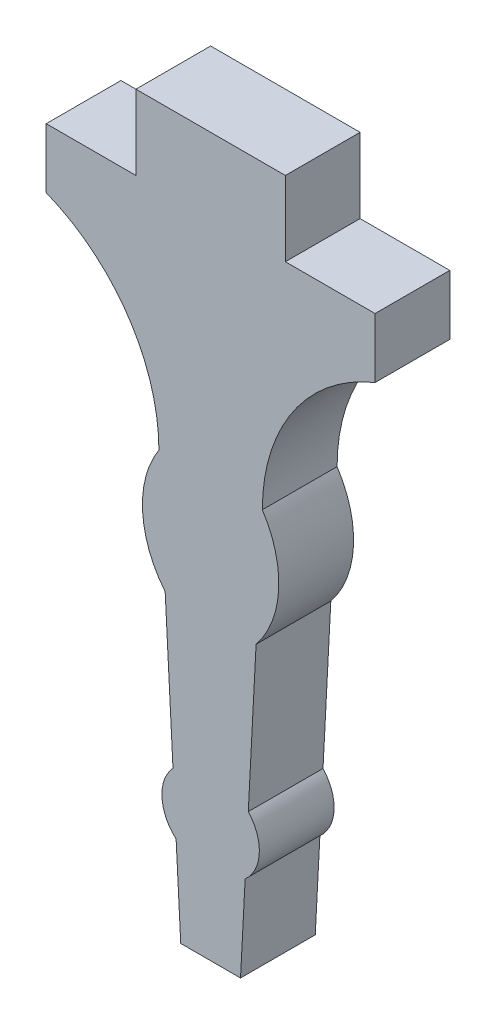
ISO-10303-21;
HEADER;
FILE_DESCRIPTION(('STEP AP214'),'2;1');
FILE_NAME('part.step','',(''),(''),'','','');
FILE_SCHEMA(('AUTOMOTIVE_DESIGN { 1 0 10303 214 1 1 1 1 }'));
ENDSEC;
DATA;
#1=APPLICATION_CONTEXT('core data for automotive mechanical design processes');
#2=APPLICATION_PROTOCOL_DEFINITION('international standard','automotive_design',2000,#1);
#3=PRODUCT_CONTEXT('',#1,'mechanical');
#4=PRODUCT('Part','Part','',(#3));
#5=PRODUCT_RELATED_PRODUCT_CATEGORY('part','',(#4));
#6=PRODUCT_DEFINITION_FORMATION('','',#4);
#7=PRODUCT_DEFINITION_CONTEXT('part definition',#1,'design');
#8=PRODUCT_DEFINITION('design','',#6,#7);
#9=PRODUCT_DEFINITION_SHAPE('','',#8);
#10=(LENGTH_UNIT() NAMED_UNIT(*) SI_UNIT(.MILLI.,.METRE.));
#11=(NAMED_UNIT(*) PLANE_ANGLE_UNIT() SI_UNIT($,.RADIAN.));
#12=(NAMED_UNIT(*) SI_UNIT($,.STERADIAN.) SOLID_ANGLE_UNIT());
#13=UNCERTAINTY_MEASURE_WITH_UNIT(LENGTH_MEASURE(1.E-05),#10,'distance_accuracy_value','');
#14=(GEOMETRIC_REPRESENTATION_CONTEXT(3) GLOBAL_UNCERTAINTY_ASSIGNED_CONTEXT((#13)) GLOBAL_UNIT_ASSIGNED_CONTEXT((#10,
#11,#12)) REPRESENTATION_CONTEXT('',''));
#15=CARTESIAN_POINT('',(0.,0.,0.));
#16=DIRECTION('',(0.,0.,1.));
#17=DIRECTION('',(1.,0.,0.));
#18=AXIS2_PLACEMENT_3D('',#15,#16,#17);
#19=CARTESIAN_POINT('',(-3.175,-3.175,3.175));
#20=DIRECTION('',(0.,-1.,0.));
#21=DIRECTION('',(1.,0.,0.));
#22=AXIS2_PLACEMENT_3D('',#19,#20,#21);
#23=PLANE('',#22);
#24=DIRECTION('',(-1.,0.,0.));
#25=VECTOR('',#24,1.);
#26=CARTESIAN_POINT('',(-3.175,-3.175,0.));
#27=LINE('',#26,#25);
#28=CARTESIAN_POINT('',(-3.175,-3.175,0.));
#29=VERTEX_POINT('',#28);
#30=CARTESIAN_POINT('',(-6.985,-3.175,0.));
#31=VERTEX_POINT('',#30);
#32=EDGE_CURVE('E189',#29,#31,#27,.T.);
#33=ORIENTED_EDGE('',*,*,#32,.T.);
#34=DIRECTION('',(0.,0.,-1.));
#35=VECTOR('',#34,1.);
#36=CARTESIAN_POINT('',(-6.985,-3.175,3.175));
#37=LINE('',#36,#35);
#38=CARTESIAN_POINT('',(-6.985,-3.175,3.175));
#39=VERTEX_POINT('',#38);
#40=EDGE_CURVE('E11',#39,#31,#37,.T.);
#41=ORIENTED_EDGE('',*,*,#40,.F.);
#42=DIRECTION('',(-1.,0.,0.));
#43=VECTOR('',#42,1.);
#44=CARTESIAN_POINT('',(-3.175,-3.175,3.175));
#45=LINE('',#44,#43);
#46=CARTESIAN_POINT('',(-3.175,-3.175,3.175));
#47=VERTEX_POINT('',#46);
#48=EDGE_CURVE('E223',#47,#39,#45,.T.);
#49=ORIENTED_EDGE('',*,*,#48,.F.);
#50=DIRECTION('',(0.,0.,-1.));
#51=VECTOR('',#50,1.);
#52=CARTESIAN_POINT('',(-3.175,-3.175,3.175));
#53=LINE('',#52,#51);
#54=EDGE_CURVE('E185',#47,#29,#53,.T.);
#55=ORIENTED_EDGE('',*,*,#54,.T.);
#56=EDGE_LOOP('',(#33,#41,#49,#55));
#57=FACE_BOUND('',#56,.T.);
#58=ADVANCED_FACE('F33',(#57),#23,.F.);
#59=CARTESIAN_POINT('',(-6.985,-3.175,3.175));
#60=DIRECTION('',(1.,0.,0.));
#61=DIRECTION('',(0.,1.,0.));
#62=AXIS2_PLACEMENT_3D('',#59,#60,#61);
#63=PLANE('',#62);
#64=DIRECTION('',(0.,-1.,0.));
#65=VECTOR('',#64,1.);
#66=CARTESIAN_POINT('',(-6.985,-3.175,0.));
#67=LINE('',#66,#65);
#68=CARTESIAN_POINT('',(-6.985,-5.715,0.));
#69=VERTEX_POINT('',#68);
#70=EDGE_CURVE('E192',#31,#69,#67,.T.);
#71=ORIENTED_EDGE('',*,*,#70,.T.);
#72=DIRECTION('',(0.,0.,-1.));
#73=VECTOR('',#72,1.);
#74=CARTESIAN_POINT('',(-6.985,-5.715,3.175));
#75=LINE('',#74,#73);
#76=CARTESIAN_POINT('',(-6.985,-5.715,3.175));
#77=VERTEX_POINT('',#76);
#78=EDGE_CURVE('E41',#77,#69,#75,.T.);
#79=ORIENTED_EDGE('',*,*,#78,.F.);
#80=DIRECTION('',(0.,-1.,0.));
#81=VECTOR('',#80,1.);
#82=CARTESIAN_POINT('',(-6.985,-3.175,3.175));
#83=LINE('',#82,#81);
#84=EDGE_CURVE('E122',#39,#77,#83,.T.);
#85=ORIENTED_EDGE('',*,*,#84,.F.);
#86=ORIENTED_EDGE('',*,*,#40,.T.);
#87=EDGE_LOOP('',(#71,#79,#85,#86));
#88=FACE_BOUND('',#87,.T.);
#89=ADVANCED_FACE('F331',(#88),#63,.F.);
#90=CARTESIAN_POINT('',(-9.81713893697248,-12.7891352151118,3.175));
#91=DIRECTION('',(0.,0.,-1.));
#92=DIRECTION('',(-1.,0.,0.));
#93=AXIS2_PLACEMENT_3D('',#90,#91,#92);
#94=CYLINDRICAL_SURFACE('',#93,7.62);
#95=CARTESIAN_POINT('',(-9.81713893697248,-12.7891352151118,0.));
#96=DIRECTION('',(0.,0.,-1.));
#97=DIRECTION('',(-1.,0.,0.));
#98=AXIS2_PLACEMENT_3D('',#95,#96,#97);
#99=CIRCLE('',#98,7.62);
#100=CARTESIAN_POINT('',(-2.19713893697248,-12.7891352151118,0.));
#101=VERTEX_POINT('',#100);
#102=EDGE_CURVE('E194',#69,#101,#99,.T.);
#103=ORIENTED_EDGE('',*,*,#102,.T.);
#104=DIRECTION('',(0.,0.,-1.));
#105=VECTOR('',#104,1.);
#106=CARTESIAN_POINT('',(-2.19713893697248,-12.7891352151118,3.175));
#107=LINE('',#106,#105);
#108=CARTESIAN_POINT('',(-2.19713893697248,-12.7891352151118,3.175));
#109=VERTEX_POINT('',#108);
#110=EDGE_CURVE('E260',#109,#101,#107,.T.);
#111=ORIENTED_EDGE('',*,*,#110,.F.);
#112=CARTESIAN_POINT('',(-9.81713893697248,-12.7891352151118,3.175));
#113=DIRECTION('',(0.,0.,-1.));
#114=DIRECTION('',(-1.,0.,0.));
#115=AXIS2_PLACEMENT_3D('',#112,#113,#114);
#116=CIRCLE('',#115,7.62);
#117=EDGE_CURVE('E268',#77,#109,#116,.T.);
#118=ORIENTED_EDGE('',*,*,#117,.F.);
#119=ORIENTED_EDGE('',*,*,#78,.T.);
#120=EDGE_LOOP('',(#103,#111,#118,#119));
#121=FACE_BOUND('',#120,.T.);
#122=ADVANCED_FACE('F266',(#121),#94,.F.);
#123=CARTESIAN_POINT('',(1.42057924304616,-15.1465149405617,3.175));
#124=DIRECTION('',(0.,0.,-1.));
#125=DIRECTION('',(-1.,0.,0.));
#126=AXIS2_PLACEMENT_3D('',#123,#124,#125);
#127=CYLINDRICAL_SURFACE('',#126,4.318);
#128=CARTESIAN_POINT('',(1.42057924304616,-15.1465149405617,0.));
#129=DIRECTION('',(0.,0.,1.));
#130=DIRECTION('',(1.,0.,0.));
#131=AXIS2_PLACEMENT_3D('',#128,#129,#130);
#132=CIRCLE('',#131,4.318);
#133=CARTESIAN_POINT('',(-1.93090741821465,-17.8691352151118,0.));
#134=VERTEX_POINT('',#133);
#135=EDGE_CURVE('E196',#101,#134,#132,.T.);
#136=ORIENTED_EDGE('',*,*,#135,.T.);
#137=DIRECTION('',(0.,0.,-1.));
#138=VECTOR('',#137,1.);
#139=CARTESIAN_POINT('',(-1.93090741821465,-17.8691352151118,3.175));
#140=LINE('',#139,#138);
#141=CARTESIAN_POINT('',(-1.93090741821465,-17.8691352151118,3.175));
#142=VERTEX_POINT('',#141);
#143=EDGE_CURVE('E257',#142,#134,#140,.T.);
#144=ORIENTED_EDGE('',*,*,#143,.F.);
#145=CARTESIAN_POINT('',(1.42057924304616,-15.1465149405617,3.175));
#146=DIRECTION('',(0.,0.,1.));
#147=DIRECTION('',(1.,0.,0.));
#148=AXIS2_PLACEMENT_3D('',#145,#146,#147);
#149=CIRCLE('',#148,4.318);
#150=EDGE_CURVE('E286',#109,#142,#149,.T.);
#151=ORIENTED_EDGE('',*,*,#150,.F.);
#152=ORIENTED_EDGE('',*,*,#110,.T.);
#153=EDGE_LOOP('',(#136,#144,#151,#152));
#154=FACE_BOUND('',#153,.T.);
#155=ADVANCED_FACE('F277',(#154),#127,.T.);
#156=CARTESIAN_POINT('',(-1.93090741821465,-17.8691352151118,3.175));
#157=DIRECTION('',(0.998629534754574,0.0523359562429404,0.));
#158=DIRECTION('',(-0.0523359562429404,0.998629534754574,0.));
#159=AXIS2_PLACEMENT_3D('',#156,#157,#158);
#160=PLANE('',#159);
#161=DIRECTION('',(0.0523359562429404,-0.998629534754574,0.));
#162=VECTOR('',#161,1.);
#163=CARTESIAN_POINT('',(-1.93090741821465,-17.8691352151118,0.));
#164=LINE('',#163,#162);
#165=CARTESIAN_POINT('',(-1.59938129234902,-24.1950305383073,0.));
#166=VERTEX_POINT('',#165);
#167=EDGE_CURVE('E198',#134,#166,#164,.T.);
#168=ORIENTED_EDGE('',*,*,#167,.T.);
#169=DIRECTION('',(0.,0.,-1.));
#170=VECTOR('',#169,1.);
#171=CARTESIAN_POINT('',(-1.59938129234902,-24.1950305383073,3.175));
#172=LINE('',#171,#170);
#173=CARTESIAN_POINT('',(-1.59938129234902,-24.1950305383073,3.175));
#174=VERTEX_POINT('',#173);
#175=EDGE_CURVE('E254',#174,#166,#172,.T.);
#176=ORIENTED_EDGE('',*,*,#175,.F.);
#177=DIRECTION('',(0.0523359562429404,-0.998629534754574,0.));
#178=VECTOR('',#177,1.);
#179=CARTESIAN_POINT('',(-1.93090741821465,-17.8691352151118,3.175));
#180=LINE('',#179,#178);
#181=EDGE_CURVE('E283',#142,#174,#180,.T.);
#182=ORIENTED_EDGE('',*,*,#181,.F.);
#183=ORIENTED_EDGE('',*,*,#143,.T.);
#184=EDGE_LOOP('',(#168,#176,#182,#183));
#185=FACE_BOUND('',#184,.T.);
#186=ADVANCED_FACE('F281',(#185),#160,.F.);
#187=CARTESIAN_POINT('',(-0.291966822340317,-25.4,3.175));
#188=DIRECTION('',(0.,0.,-1.));
#189=DIRECTION('',(-1.,0.,0.));
#190=AXIS2_PLACEMENT_3D('',#187,#188,#189);
#191=CYLINDRICAL_SURFACE('',#190,1.778);
#192=CARTESIAN_POINT('',(-0.291966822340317,-25.4,0.));
#193=DIRECTION('',(0.,0.,1.));
#194=DIRECTION('',(-1.,0.,0.));
#195=AXIS2_PLACEMENT_3D('',#192,#193,#194);
#196=CIRCLE('',#195,1.778);
#197=CARTESIAN_POINT('',(-1.4662655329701,-26.7350305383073,0.));
#198=VERTEX_POINT('',#197);
#199=EDGE_CURVE('E200',#166,#198,#196,.T.);
#200=ORIENTED_EDGE('',*,*,#199,.T.);
#201=DIRECTION('',(0.,0.,-1.));
#202=VECTOR('',#201,1.);
#203=CARTESIAN_POINT('',(-1.4662655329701,-26.7350305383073,3.175));
#204=LINE('',#203,#202);
#205=CARTESIAN_POINT('',(-1.4662655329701,-26.7350305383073,3.175));
#206=VERTEX_POINT('',#205);
#207=EDGE_CURVE('E251',#206,#198,#204,.T.);
#208=ORIENTED_EDGE('',*,*,#207,.F.);
#209=CARTESIAN_POINT('',(-0.291966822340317,-25.4,3.175));
#210=DIRECTION('',(0.,0.,1.));
#211=DIRECTION('',(-1.,0.,0.));
#212=AXIS2_PLACEMENT_3D('',#209,#210,#211);
#213=CIRCLE('',#212,1.778);
#214=EDGE_CURVE('E285',#174,#206,#213,.T.);
#215=ORIENTED_EDGE('',*,*,#214,.F.);
#216=ORIENTED_EDGE('',*,*,#175,.T.);
#217=EDGE_LOOP('',(#200,#208,#215,#216));
#218=FACE_BOUND('',#217,.T.);
#219=ADVANCED_FACE('F344',(#218),#191,.T.);
#220=CARTESIAN_POINT('',(-1.4662655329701,-26.7350305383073,3.175));
#221=DIRECTION('',(0.998629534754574,0.0523359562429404,0.));
#222=DIRECTION('',(-0.0523359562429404,0.998629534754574,0.));
#223=AXIS2_PLACEMENT_3D('',#220,#221,#222);
#224=PLANE('',#223);
#225=DIRECTION('',(0.0523359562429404,-0.998629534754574,0.));
#226=VECTOR('',#225,1.);
#227=CARTESIAN_POINT('',(-1.4662655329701,-26.7350305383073,0.));
#228=LINE('',#227,#226);
#229=CARTESIAN_POINT('',(-1.27,-30.48,0.));
#230=VERTEX_POINT('',#229);
#231=EDGE_CURVE('E202',#198,#230,#228,.T.);
#232=ORIENTED_EDGE('',*,*,#231,.T.);
#233=DIRECTION('',(0.,0.,-1.));
#234=VECTOR('',#233,1.);
#235=CARTESIAN_POINT('',(-1.27,-30.48,3.175));
#236=LINE('',#235,#234);
#237=CARTESIAN_POINT('',(-1.27,-30.48,3.175));
#238=VERTEX_POINT('',#237);
#239=EDGE_CURVE('E248',#238,#230,#236,.T.);
#240=ORIENTED_EDGE('',*,*,#239,.F.);
#241=DIRECTION('',(0.0523359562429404,-0.998629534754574,0.));
#242=VECTOR('',#241,1.);
#243=CARTESIAN_POINT('',(-1.4662655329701,-26.7350305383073,3.175));
#244=LINE('',#243,#242);
#245=EDGE_CURVE('E288',#206,#238,#244,.T.);
#246=ORIENTED_EDGE('',*,*,#245,.F.);
#247=ORIENTED_EDGE('',*,*,#207,.T.);
#248=EDGE_LOOP('',(#232,#240,#246,#247));
#249=FACE_BOUND('',#248,.T.);
#250=ADVANCED_FACE('F347',(#249),#224,.F.);
#251=CARTESIAN_POINT('',(-1.27,-30.48,3.175));
#252=DIRECTION('',(0.,1.,0.));
#253=DIRECTION('',(0.,0.,1.));
#254=AXIS2_PLACEMENT_3D('',#251,#252,#253);
#255=PLANE('',#254);
#256=DIRECTION('',(1.,0.,0.));
#257=VECTOR('',#256,1.);
#258=CARTESIAN_POINT('',(-1.27,-30.48,0.));
#259=LINE('',#258,#257);
#260=CARTESIAN_POINT('',(1.27,-30.48,0.));
#261=VERTEX_POINT('',#260);
#262=EDGE_CURVE('E204',#230,#261,#259,.T.);
#263=ORIENTED_EDGE('',*,*,#262,.T.);
#264=DIRECTION('',(0.,0.,-1.));
#265=VECTOR('',#264,1.);
#266=CARTESIAN_POINT('',(1.27,-30.48,3.175));
#267=LINE('',#266,#265);
#268=CARTESIAN_POINT('',(1.27,-30.48,3.175));
#269=VERTEX_POINT('',#268);
#270=EDGE_CURVE('E245',#269,#261,#267,.T.);
#271=ORIENTED_EDGE('',*,*,#270,.F.);
#272=DIRECTION('',(1.,0.,0.));
#273=VECTOR('',#272,1.);
#274=CARTESIAN_POINT('',(-1.27,-30.48,3.175));
#275=LINE('',#274,#273);
#276=EDGE_CURVE('E294',#238,#269,#275,.T.);
#277=ORIENTED_EDGE('',*,*,#276,.F.);
#278=ORIENTED_EDGE('',*,*,#239,.T.);
#279=EDGE_LOOP('',(#263,#271,#277,#278));
#280=FACE_BOUND('',#279,.T.);
#281=ADVANCED_FACE('F351',(#280),#255,.F.);
#282=CARTESIAN_POINT('',(1.46626553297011,-26.7350305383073,3.175));
#283=DIRECTION('',(-0.998629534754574,0.0523359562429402,0.));
#284=DIRECTION('',(-0.0523359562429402,-0.998629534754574,0.));
#285=AXIS2_PLACEMENT_3D('',#282,#283,#284);
#286=PLANE('',#285);
#287=DIRECTION('',(0.0523359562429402,0.998629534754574,0.));
#288=VECTOR('',#287,1.);
#289=CARTESIAN_POINT('',(1.46626553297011,-26.7350305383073,0.));
#290=LINE('',#289,#288);
#291=CARTESIAN_POINT('',(1.46626553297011,-26.7350305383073,0.));
#292=VERTEX_POINT('',#291);
#293=EDGE_CURVE('E206',#261,#292,#290,.T.);
#294=ORIENTED_EDGE('',*,*,#293,.T.);
#295=DIRECTION('',(0.,0.,-1.));
#296=VECTOR('',#295,1.);
#297=CARTESIAN_POINT('',(1.46626553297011,-26.7350305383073,3.175));
#298=LINE('',#297,#296);
#299=CARTESIAN_POINT('',(1.46626553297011,-26.7350305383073,3.175));
#300=VERTEX_POINT('',#299);
#301=EDGE_CURVE('E242',#300,#292,#298,.T.);
#302=ORIENTED_EDGE('',*,*,#301,.F.);
#303=DIRECTION('',(0.0523359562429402,0.998629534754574,0.));
#304=VECTOR('',#303,1.);
#305=CARTESIAN_POINT('',(1.46626553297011,-26.7350305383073,3.175));
#306=LINE('',#305,#304);
#307=EDGE_CURVE('E296',#269,#300,#306,.T.);
#308=ORIENTED_EDGE('',*,*,#307,.F.);
#309=ORIENTED_EDGE('',*,*,#270,.T.);
#310=EDGE_LOOP('',(#294,#302,#308,#309));
#311=FACE_BOUND('',#310,.T.);
#312=ADVANCED_FACE('F355',(#311),#286,.F.);
#313=CARTESIAN_POINT('',(0.291966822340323,-25.4,3.175));
#314=DIRECTION('',(0.,0.,-1.));
#315=DIRECTION('',(-1.,0.,0.));
#316=AXIS2_PLACEMENT_3D('',#313,#314,#315);
#317=CYLINDRICAL_SURFACE('',#316,1.778);
#318=CARTESIAN_POINT('',(0.291966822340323,-25.4,0.));
#319=DIRECTION('',(0.,0.,1.));
#320=DIRECTION('',(1.,0.,0.));
#321=AXIS2_PLACEMENT_3D('',#318,#319,#320);
#322=CIRCLE('',#321,1.778);
#323=CARTESIAN_POINT('',(1.59938129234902,-24.1950305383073,0.));
#324=VERTEX_POINT('',#323);
#325=EDGE_CURVE('E208',#292,#324,#322,.T.);
#326=ORIENTED_EDGE('',*,*,#325,.T.);
#327=DIRECTION('',(0.,0.,-1.));
#328=VECTOR('',#327,1.);
#329=CARTESIAN_POINT('',(1.59938129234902,-24.1950305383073,3.175));
#330=LINE('',#329,#328);
#331=CARTESIAN_POINT('',(1.59938129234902,-24.1950305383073,3.175));
#332=VERTEX_POINT('',#331);
#333=EDGE_CURVE('E239',#332,#324,#330,.T.);
#334=ORIENTED_EDGE('',*,*,#333,.F.);
#335=CARTESIAN_POINT('',(0.291966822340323,-25.4,3.175));
#336=DIRECTION('',(0.,0.,1.));
#337=DIRECTION('',(1.,0.,0.));
#338=AXIS2_PLACEMENT_3D('',#335,#336,#337);
#339=CIRCLE('',#338,1.778);
#340=EDGE_CURVE('E298',#300,#332,#339,.T.);
#341=ORIENTED_EDGE('',*,*,#340,.F.);
#342=ORIENTED_EDGE('',*,*,#301,.T.);
#343=EDGE_LOOP('',(#326,#334,#341,#342));
#344=FACE_BOUND('',#343,.T.);
#345=ADVANCED_FACE('F359',(#344),#317,.T.);
#346=CARTESIAN_POINT('',(1.93090741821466,-17.8691352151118,3.175));
#347=DIRECTION('',(-0.998629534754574,0.0523359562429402,0.));
#348=DIRECTION('',(-0.0523359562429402,-0.998629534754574,0.));
#349=AXIS2_PLACEMENT_3D('',#346,#347,#348);
#350=PLANE('',#349);
#351=DIRECTION('',(0.0523359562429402,0.998629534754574,0.));
#352=VECTOR('',#351,1.);
#353=CARTESIAN_POINT('',(1.93090741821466,-17.8691352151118,0.));
#354=LINE('',#353,#352);
#355=CARTESIAN_POINT('',(1.93090741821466,-17.8691352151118,0.));
#356=VERTEX_POINT('',#355);
#357=EDGE_CURVE('E210',#324,#356,#354,.T.);
#358=ORIENTED_EDGE('',*,*,#357,.T.);
#359=DIRECTION('',(0.,0.,-1.));
#360=VECTOR('',#359,1.);
#361=CARTESIAN_POINT('',(1.93090741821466,-17.8691352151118,3.175));
#362=LINE('',#361,#360);
#363=CARTESIAN_POINT('',(1.93090741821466,-17.8691352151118,3.175));
#364=VERTEX_POINT('',#363);
#365=EDGE_CURVE('E236',#364,#356,#362,.T.);
#366=ORIENTED_EDGE('',*,*,#365,.F.);
#367=DIRECTION('',(0.0523359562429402,0.998629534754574,0.));
#368=VECTOR('',#367,1.);
#369=CARTESIAN_POINT('',(1.93090741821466,-17.8691352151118,3.175));
#370=LINE('',#369,#368);
#371=EDGE_CURVE('E300',#332,#364,#370,.T.);
#372=ORIENTED_EDGE('',*,*,#371,.F.);
#373=ORIENTED_EDGE('',*,*,#333,.T.);
#374=EDGE_LOOP('',(#358,#366,#372,#373));
#375=FACE_BOUND('',#374,.T.);
#376=ADVANCED_FACE('F363',(#375),#350,.F.);
#377=CARTESIAN_POINT('',(-1.42057924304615,-15.1465149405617,3.175));
#378=DIRECTION('',(0.,0.,-1.));
#379=DIRECTION('',(-1.,0.,0.));
#380=AXIS2_PLACEMENT_3D('',#377,#378,#379);
#381=CYLINDRICAL_SURFACE('',#380,4.318);
#382=CARTESIAN_POINT('',(-1.42057924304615,-15.1465149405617,0.));
#383=DIRECTION('',(0.,0.,1.));
#384=DIRECTION('',(-1.,0.,0.));
#385=AXIS2_PLACEMENT_3D('',#382,#383,#384);
#386=CIRCLE('',#385,4.318);
#387=CARTESIAN_POINT('',(2.19713893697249,-12.7891352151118,0.));
#388=VERTEX_POINT('',#387);
#389=EDGE_CURVE('E212',#356,#388,#386,.T.);
#390=ORIENTED_EDGE('',*,*,#389,.T.);
#391=DIRECTION('',(0.,0.,-1.));
#392=VECTOR('',#391,1.);
#393=CARTESIAN_POINT('',(2.19713893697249,-12.7891352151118,3.175));
#394=LINE('',#393,#392);
#395=CARTESIAN_POINT('',(2.19713893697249,-12.7891352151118,3.175));
#396=VERTEX_POINT('',#395);
#397=EDGE_CURVE('E233',#396,#388,#394,.T.);
#398=ORIENTED_EDGE('',*,*,#397,.F.);
#399=CARTESIAN_POINT('',(-1.42057924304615,-15.1465149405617,3.175));
#400=DIRECTION('',(0.,0.,1.));
#401=DIRECTION('',(-1.,0.,0.));
#402=AXIS2_PLACEMENT_3D('',#399,#400,#401);
#403=CIRCLE('',#402,4.318);
#404=EDGE_CURVE('E302',#364,#396,#403,.T.);
#405=ORIENTED_EDGE('',*,*,#404,.F.);
#406=ORIENTED_EDGE('',*,*,#365,.T.);
#407=EDGE_LOOP('',(#390,#398,#405,#406));
#408=FACE_BOUND('',#407,.T.);
#409=ADVANCED_FACE('F367',(#408),#381,.T.);
#410=CARTESIAN_POINT('',(9.81713893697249,-12.7891352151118,3.175));
#411=DIRECTION('',(0.,0.,-1.));
#412=DIRECTION('',(-1.,0.,0.));
#413=AXIS2_PLACEMENT_3D('',#410,#411,#412);
#414=CYLINDRICAL_SURFACE('',#413,7.62);
#415=CARTESIAN_POINT('',(9.81713893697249,-12.7891352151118,0.));
#416=DIRECTION('',(0.,0.,-1.));
#417=DIRECTION('',(1.,0.,0.));
#418=AXIS2_PLACEMENT_3D('',#415,#416,#417);
#419=CIRCLE('',#418,7.62);
#420=CARTESIAN_POINT('',(6.985,-5.715,0.));
#421=VERTEX_POINT('',#420);
#422=EDGE_CURVE('E214',#388,#421,#419,.T.);
#423=ORIENTED_EDGE('',*,*,#422,.T.);
#424=DIRECTION('',(0.,0.,-1.));
#425=VECTOR('',#424,1.);
#426=CARTESIAN_POINT('',(6.985,-5.715,3.175));
#427=LINE('',#426,#425);
#428=CARTESIAN_POINT('',(6.985,-5.715,3.175));
#429=VERTEX_POINT('',#428);
#430=EDGE_CURVE('E230',#429,#421,#427,.T.);
#431=ORIENTED_EDGE('',*,*,#430,.F.);
#432=CARTESIAN_POINT('',(9.81713893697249,-12.7891352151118,3.175));
#433=DIRECTION('',(0.,0.,-1.));
#434=DIRECTION('',(1.,0.,0.));
#435=AXIS2_PLACEMENT_3D('',#432,#433,#434);
#436=CIRCLE('',#435,7.62);
#437=EDGE_CURVE('E304',#396,#429,#436,.T.);
#438=ORIENTED_EDGE('',*,*,#437,.F.);
#439=ORIENTED_EDGE('',*,*,#397,.T.);
#440=EDGE_LOOP('',(#423,#431,#438,#439));
#441=FACE_BOUND('',#440,.T.);
#442=ADVANCED_FACE('F371',(#441),#414,.F.);
#443=CARTESIAN_POINT('',(6.985,-3.175,3.175));
#444=DIRECTION('',(-1.,0.,0.));
#445=DIRECTION('',(0.,0.,1.));
#446=AXIS2_PLACEMENT_3D('',#443,#444,#445);
#447=PLANE('',#446);
#448=DIRECTION('',(0.,1.,0.));
#449=VECTOR('',#448,1.);
#450=CARTESIAN_POINT('',(6.985,-3.175,0.));
#451=LINE('',#450,#449);
#452=CARTESIAN_POINT('',(6.985,-3.175,0.));
#453=VERTEX_POINT('',#452);
#454=EDGE_CURVE('E216',#421,#453,#451,.T.);
#455=ORIENTED_EDGE('',*,*,#454,.T.);
#456=DIRECTION('',(0.,0.,-1.));
#457=VECTOR('',#456,1.);
#458=CARTESIAN_POINT('',(6.985,-3.175,3.175));
#459=LINE('',#458,#457);
#460=CARTESIAN_POINT('',(6.985,-3.175,3.175));
#461=VERTEX_POINT('',#460);
#462=EDGE_CURVE('E227',#461,#453,#459,.T.);
#463=ORIENTED_EDGE('',*,*,#462,.F.);
#464=DIRECTION('',(0.,1.,0.));
#465=VECTOR('',#464,1.);
#466=CARTESIAN_POINT('',(6.985,-3.175,3.175));
#467=LINE('',#466,#465);
#468=EDGE_CURVE('E306',#429,#461,#467,.T.);
#469=ORIENTED_EDGE('',*,*,#468,.F.);
#470=ORIENTED_EDGE('',*,*,#430,.T.);
#471=EDGE_LOOP('',(#455,#463,#469,#470));
#472=FACE_BOUND('',#471,.T.);
#473=ADVANCED_FACE('F312',(#472),#447,.F.);
#474=CARTESIAN_POINT('',(3.175,-3.175,3.175));
#475=DIRECTION('',(0.,-1.,0.));
#476=DIRECTION('',(1.,0.,0.));
#477=AXIS2_PLACEMENT_3D('',#474,#475,#476);
#478=PLANE('',#477);
#479=DIRECTION('',(-1.,0.,0.));
#480=VECTOR('',#479,1.);
#481=CARTESIAN_POINT('',(3.175,-3.175,0.));
#482=LINE('',#481,#480);
#483=CARTESIAN_POINT('',(3.175,-3.175,0.));
#484=VERTEX_POINT('',#483);
#485=EDGE_CURVE('E218',#453,#484,#482,.T.);
#486=ORIENTED_EDGE('',*,*,#485,.T.);
#487=DIRECTION('',(0.,0.,-1.));
#488=VECTOR('',#487,1.);
#489=CARTESIAN_POINT('',(3.175,-3.175,3.175));
#490=LINE('',#489,#488);
#491=CARTESIAN_POINT('',(3.175,-3.175,3.175));
#492=VERTEX_POINT('',#491);
#493=EDGE_CURVE('E180',#492,#484,#490,.T.);
#494=ORIENTED_EDGE('',*,*,#493,.F.);
#495=DIRECTION('',(-1.,0.,0.));
#496=VECTOR('',#495,1.);
#497=CARTESIAN_POINT('',(3.175,-3.175,3.175));
#498=LINE('',#497,#496);
#499=EDGE_CURVE('E171',#461,#492,#498,.T.);
#500=ORIENTED_EDGE('',*,*,#499,.F.);
#501=ORIENTED_EDGE('',*,*,#462,.T.);
#502=EDGE_LOOP('',(#486,#494,#500,#501));
#503=FACE_BOUND('',#502,.T.);
#504=ADVANCED_FACE('F316',(#503),#478,.F.);
#505=CARTESIAN_POINT('',(3.175,0.,3.175));
#506=DIRECTION('',(-1.,0.,0.));
#507=DIRECTION('',(0.,-1.,0.));
#508=AXIS2_PLACEMENT_3D('',#505,#506,#507);
#509=PLANE('',#508);
#510=DIRECTION('',(0.,1.,0.));
#511=VECTOR('',#510,1.);
#512=CARTESIAN_POINT('',(3.175,0.,0.));
#513=LINE('',#512,#511);
#514=CARTESIAN_POINT('',(3.175,0.,0.));
#515=VERTEX_POINT('',#514);
#516=EDGE_CURVE('E179',#484,#515,#513,.T.);
#517=ORIENTED_EDGE('',*,*,#516,.T.);
#518=DIRECTION('',(0.,0.,-1.));
#519=VECTOR('',#518,1.);
#520=CARTESIAN_POINT('',(3.175,0.,3.175));
#521=LINE('',#520,#519);
#522=CARTESIAN_POINT('',(3.175,0.,3.175));
#523=VERTEX_POINT('',#522);
#524=EDGE_CURVE('E176',#523,#515,#521,.T.);
#525=ORIENTED_EDGE('',*,*,#524,.F.);
#526=DIRECTION('',(0.,1.,0.));
#527=VECTOR('',#526,1.);
#528=CARTESIAN_POINT('',(3.175,0.,3.175));
#529=LINE('',#528,#527);
#530=EDGE_CURVE('E165',#492,#523,#529,.T.);
#531=ORIENTED_EDGE('',*,*,#530,.F.);
#532=ORIENTED_EDGE('',*,*,#493,.T.);
#533=EDGE_LOOP('',(#517,#525,#531,#532));
#534=FACE_BOUND('',#533,.T.);
#535=ADVANCED_FACE('F177',(#534),#509,.F.);
#536=CARTESIAN_POINT('',(3.175,0.,3.175));
#537=DIRECTION('',(0.,-1.,0.));
#538=DIRECTION('',(0.,0.,-1.));
#539=AXIS2_PLACEMENT_3D('',#536,#537,#538);
#540=PLANE('',#539);
#541=DIRECTION('',(-1.,0.,0.));
#542=VECTOR('',#541,1.);
#543=CARTESIAN_POINT('',(3.175,0.,0.));
#544=LINE('',#543,#542);
#545=CARTESIAN_POINT('',(-3.175,0.,0.));
#546=VERTEX_POINT('',#545);
#547=EDGE_CURVE('E108',#515,#546,#544,.T.);
#548=ORIENTED_EDGE('',*,*,#547,.T.);
#549=DIRECTION('',(0.,0.,-1.));
#550=VECTOR('',#549,1.);
#551=CARTESIAN_POINT('',(-3.175,0.,3.175));
#552=LINE('',#551,#550);
#553=CARTESIAN_POINT('',(-3.175,0.,3.175));
#554=VERTEX_POINT('',#553);
#555=EDGE_CURVE('E181',#554,#546,#552,.T.);
#556=ORIENTED_EDGE('',*,*,#555,.F.);
#557=DIRECTION('',(-1.,0.,0.));
#558=VECTOR('',#557,1.);
#559=CARTESIAN_POINT('',(3.175,0.,3.175));
#560=LINE('',#559,#558);
#561=EDGE_CURVE('E169',#523,#554,#560,.T.);
#562=ORIENTED_EDGE('',*,*,#561,.F.);
#563=ORIENTED_EDGE('',*,*,#524,.T.);
#564=EDGE_LOOP('',(#548,#556,#562,#563));
#565=FACE_BOUND('',#564,.T.);
#566=ADVANCED_FACE('F183',(#565),#540,.F.);
#567=CARTESIAN_POINT('',(-3.175,0.,3.175));
#568=DIRECTION('',(1.,0.,0.));
#569=DIRECTION('',(0.,1.,0.));
#570=AXIS2_PLACEMENT_3D('',#567,#568,#569);
#571=PLANE('',#570);
#572=DIRECTION('',(0.,-1.,0.));
#573=VECTOR('',#572,1.);
#574=CARTESIAN_POINT('',(-3.175,0.,0.));
#575=LINE('',#574,#573);
#576=EDGE_CURVE('E114',#546,#29,#575,.T.);
#577=ORIENTED_EDGE('',*,*,#576,.T.);
#578=ORIENTED_EDGE('',*,*,#54,.F.);
#579=DIRECTION('',(0.,-1.,0.));
#580=VECTOR('',#579,1.);
#581=CARTESIAN_POINT('',(-3.175,0.,3.175));
#582=LINE('',#581,#580);
#583=EDGE_CURVE('E49',#554,#47,#582,.T.);
#584=ORIENTED_EDGE('',*,*,#583,.F.);
#585=ORIENTED_EDGE('',*,*,#555,.T.);
#586=EDGE_LOOP('',(#577,#578,#584,#585));
#587=FACE_BOUND('',#586,.T.);
#588=ADVANCED_FACE('F320',(#587),#571,.F.);
#589=CARTESIAN_POINT('',(-9.81713893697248,-12.7891352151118,3.175));
#590=DIRECTION('',(0.,0.,-1.));
#591=DIRECTION('',(-1.,0.,0.));
#592=AXIS2_PLACEMENT_3D('',#589,#590,#591);
#593=PLANE('',#592);
#594=ORIENTED_EDGE('',*,*,#48,.T.);
#595=ORIENTED_EDGE('',*,*,#84,.T.);
#596=ORIENTED_EDGE('',*,*,#117,.T.);
#597=ORIENTED_EDGE('',*,*,#150,.T.);
#598=ORIENTED_EDGE('',*,*,#181,.T.);
#599=ORIENTED_EDGE('',*,*,#214,.T.);
#600=ORIENTED_EDGE('',*,*,#245,.T.);
#601=ORIENTED_EDGE('',*,*,#276,.T.);
#602=ORIENTED_EDGE('',*,*,#307,.T.);
#603=ORIENTED_EDGE('',*,*,#340,.T.);
#604=ORIENTED_EDGE('',*,*,#371,.T.);
#605=ORIENTED_EDGE('',*,*,#404,.T.);
#606=ORIENTED_EDGE('',*,*,#437,.T.);
#607=ORIENTED_EDGE('',*,*,#468,.T.);
#608=ORIENTED_EDGE('',*,*,#499,.T.);
#609=ORIENTED_EDGE('',*,*,#530,.T.);
#610=ORIENTED_EDGE('',*,*,#561,.T.);
#611=ORIENTED_EDGE('',*,*,#583,.T.);
#612=EDGE_LOOP('',(#594,#595,#596,#597,#598,#599,#600,#601,#602,#603,#604,#605,#606,#607,#608,
#609,#610,#611));
#613=FACE_BOUND('',#612,.T.);
#614=ADVANCED_FACE('F167',(#613),#593,.F.);
#615=CARTESIAN_POINT('',(-9.81713893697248,-12.7891352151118,0.));
#616=DIRECTION('',(0.,0.,-1.));
#617=DIRECTION('',(-1.,0.,0.));
#618=AXIS2_PLACEMENT_3D('',#615,#616,#617);
#619=PLANE('',#618);
#620=ORIENTED_EDGE('',*,*,#32,.F.);
#621=ORIENTED_EDGE('',*,*,#576,.F.);
#622=ORIENTED_EDGE('',*,*,#547,.F.);
#623=ORIENTED_EDGE('',*,*,#516,.F.);
#624=ORIENTED_EDGE('',*,*,#485,.F.);
#625=ORIENTED_EDGE('',*,*,#454,.F.);
#626=ORIENTED_EDGE('',*,*,#422,.F.);
#627=ORIENTED_EDGE('',*,*,#389,.F.);
#628=ORIENTED_EDGE('',*,*,#357,.F.);
#629=ORIENTED_EDGE('',*,*,#325,.F.);
#630=ORIENTED_EDGE('',*,*,#293,.F.);
#631=ORIENTED_EDGE('',*,*,#262,.F.);
#632=ORIENTED_EDGE('',*,*,#231,.F.);
#633=ORIENTED_EDGE('',*,*,#199,.F.);
#634=ORIENTED_EDGE('',*,*,#167,.F.);
#635=ORIENTED_EDGE('',*,*,#135,.F.);
#636=ORIENTED_EDGE('',*,*,#102,.F.);
#637=ORIENTED_EDGE('',*,*,#70,.F.);
#638=EDGE_LOOP('',(#620,#621,#622,#623,#624,#625,#626,#627,#628,#629,#630,#631,#632,#633,#634,
#635,#636,#637));
#639=FACE_BOUND('',#638,.T.);
#640=ADVANCED_FACE('F272',(#639),#619,.T.);
#641=CLOSED_SHELL('',(#58,#89,#122,#155,#186,#219,#250,#281,#312,#345,#376,#409,#442,#473,#504,
#535,#566,#588,#614,#640));
#642=MANIFOLD_SOLID_BREP('B2',#641);
#643=ADVANCED_BREP_SHAPE_REPRESENTATION('',(#18,#642),#14);
#644=SHAPE_DEFINITION_REPRESENTATION(#9,#643);
ENDSEC;
END-ISO-10303-21;
